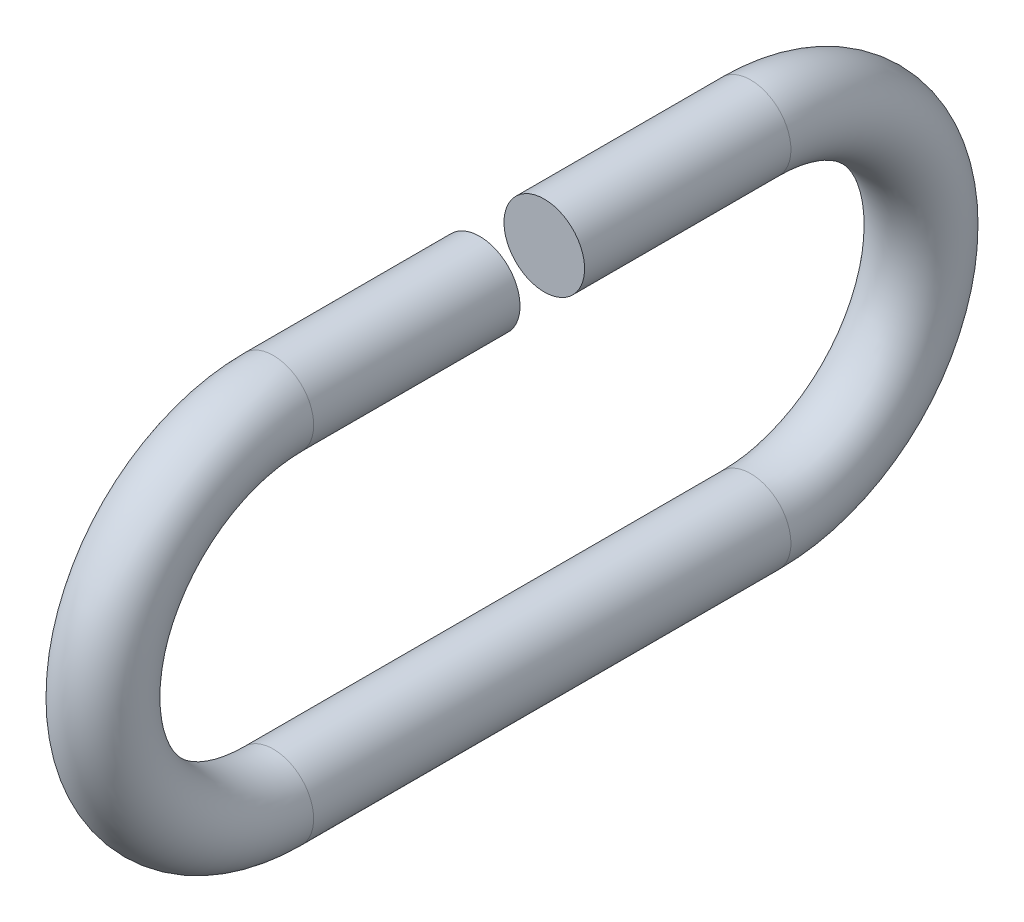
from build123d import *

# Parameters (mm, degrees)
SKETCH2_R               = 1.9812
CUT_EXTRUDE1_DEPTH      = 25.487602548
CUT_EXTRUDE1_DEPTH_BACK = 25.487602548
SKETCH3_W               = 3.175
SKETCH3_H               = 5.08


with BuildPart() as part:
    # Sweep1: sweep along a path in Sketch1
    with BuildLine(Plane(origin=(0, 0, 0), x_dir=(0, 0, -1), z_dir=(1, 0, 0))) as sweep1_path:
        Line((-11.7348, 8.382), (11.7348, 8.382))
        ThreePointArc((11.7348, 8.382), (20.1168, 0), (11.7348, -8.382))
        Line((11.7348, -8.382), (-11.7348, -8.382))
        ThreePointArc((-11.7348, -8.382), (-20.1168, 0), (-11.7348, 8.382))
    # Sketch2 → Sweep1 (sweep)
    with BuildSketch(Plane.XY):
        with Locations((0, 8.382)):
            Circle(SKETCH2_R)
    sweep(path=sweep1_path.line)

    # Sketch3 → Cut-Extrude1 (cut, two sides: drawn at the far end of the back side and taken through both)
    with BuildSketch(Plane(origin=(0, 0, 0), x_dir=(0, 0, -1), z_dir=(1, 0, 0)).offset(-CUT_EXTRUDE1_DEPTH_BACK)):
        with Locations((0, 8.382)):
            Rectangle(SKETCH3_W, SKETCH3_H)
    extrude(amount=CUT_EXTRUDE1_DEPTH + CUT_EXTRUDE1_DEPTH_BACK, mode=Mode.SUBTRACT)


solid = part.part
